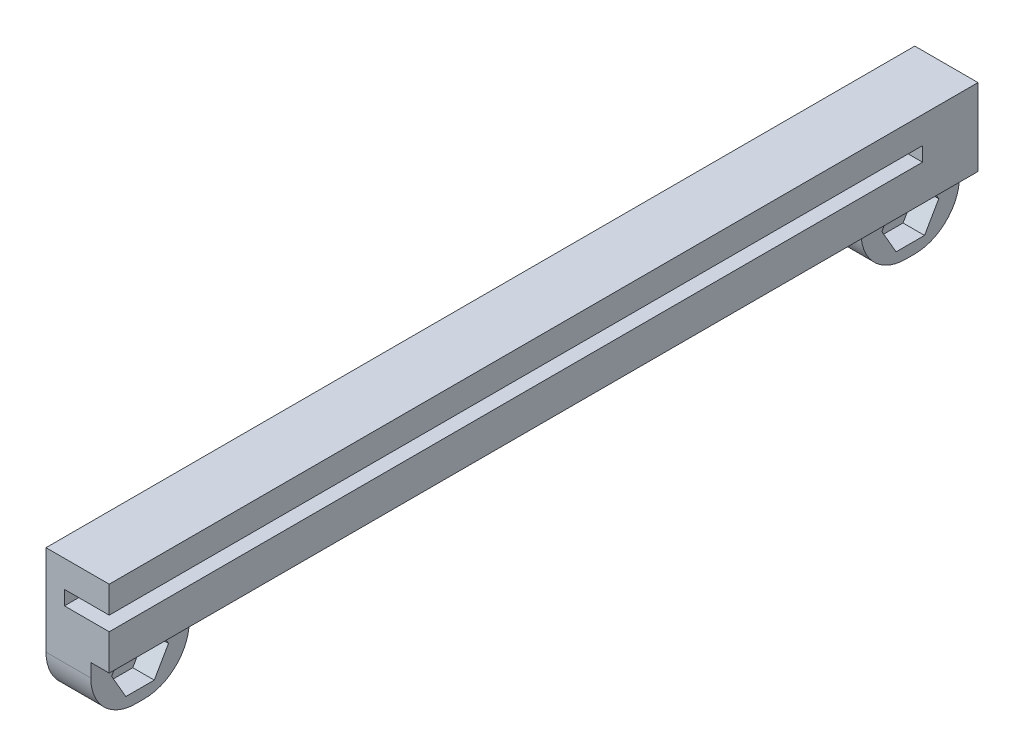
from build123d import *

# Parameters (mm, degrees)
SKETCH1_W           = 7.0575
SKETCH1_H           = 97
BOSS_EXTRUDE2_DEPTH = 7.6
SKETCH4_W           = 5
SKETCH4_H           = 90.805
CUT_EXTRUDE1_DEPTH  = 4.6
SKETCH6_W           = 5
SKETCH6_H           = 90.805
BOSS_EXTRUDE3_DEPTH = 3
SKETCH8_W           = 7.0575
SKETCH8_H           = 97
BOSS_EXTRUDE4_DEPTH = 1
SKETCH9_W           = 5
SKETCH9_H           = 11
BOSS_EXTRUDE5_DEPTH = 6.5
CUT_EXTRUDE2_DEPTH  = 2.4
SKETCH11_R          = 1.6
CUT_EXTRUDE3_DEPTH  = 50.293805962
FILLET2_R           = 5


with BuildPart() as part:
    # Sketch1 → Boss-Extrude2 (new body)
    with BuildSketch(Plane(origin=(0, 0, 0), x_dir=(1, 0, 0), z_dir=(0, 1, 0))):
        Rectangle(SKETCH1_W, SKETCH1_H)
    extrude(amount=BOSS_EXTRUDE2_DEPTH)

    # Sketch4 → Cut-Extrude1 (cut)
    with BuildSketch(Plane(origin=(0, 7.6, 0), x_dir=(1, 0, 0), z_dir=(0, 1, 0))):
        with Locations((1.02875, -3.0975)):
            Rectangle(SKETCH4_W, SKETCH4_H)
    extrude(amount=-CUT_EXTRUDE1_DEPTH, mode=Mode.SUBTRACT)

    # Sketch6 → Boss-Extrude3 (add)
    with BuildSketch(Plane(origin=(0, 7.6, 0), x_dir=(1, 0, 0), z_dir=(0, 1, 0))):
        with Locations((1.02875, -3.0975)):
            Rectangle(SKETCH6_W, SKETCH6_H)
    extrude(amount=-BOSS_EXTRUDE3_DEPTH)

    # Sketch8 → Boss-Extrude4 (add)
    with BuildSketch(Plane.XZ):
        Rectangle(SKETCH8_W, SKETCH8_H)
    extrude(amount=BOSS_EXTRUDE4_DEPTH)

    # Sketch9 → Boss-Extrude5 (add)
    with BuildSketch(Plane.XZ.offset(1)):
        with Locations((-1.02875, 43)):
            Rectangle(SKETCH9_W, SKETCH9_H)
        with Locations((-1.02875, -43)):
            Rectangle(SKETCH9_W, SKETCH9_H)
    extrude(amount=BOSS_EXTRUDE5_DEPTH)

    # Sketch10 → Cut-Extrude2 (cut)
    with BuildSketch(Plane(origin=(1.47125, 0, 0), x_dir=(0, 0, -1), z_dir=(1, 0, 0))):
        Polygon((-44.58771324, -0.75), (-46.175426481, -3.5), (-44.58771324, -6.25), (-41.41228676, -6.25), (-39.824573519, -3.5), (-41.41228676, -0.75), align=None)
        Polygon((46.175426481, -3.5), (44.58771324, -0.75), (41.41228676, -0.75), (39.824573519, -3.5), (41.41228676, -6.25), (44.58771324, -6.25), align=None)
    extrude(amount=-CUT_EXTRUDE2_DEPTH, mode=Mode.SUBTRACT)

    # Sketch11 → Cut-Extrude3 (cut, through all)
    with BuildSketch(Plane(origin=(-0.92875, 0, 0), x_dir=(0, 0, -1), z_dir=(1, 0, 0))):
        with Locations((-43, -3.5)):
            Circle(SKETCH11_R)
        with Locations((43, -3.5)):
            Circle(SKETCH11_R)
    extrude(amount=-CUT_EXTRUDE3_DEPTH, mode=Mode.SUBTRACT)

    # Fillet2
    fillet2_edges = [part.edges().sort_by_distance(p)[0] for p in [
        (-1.02875, -7.5, 48.5),
        (-1.02875, -7.5, 37.5),
        (-1.02875, -7.5, -37.5),
        (-1.02875, -7.5, -48.5),
    ]]
    fillet(fillet2_edges, radius=FILLET2_R)


solid = part.part
